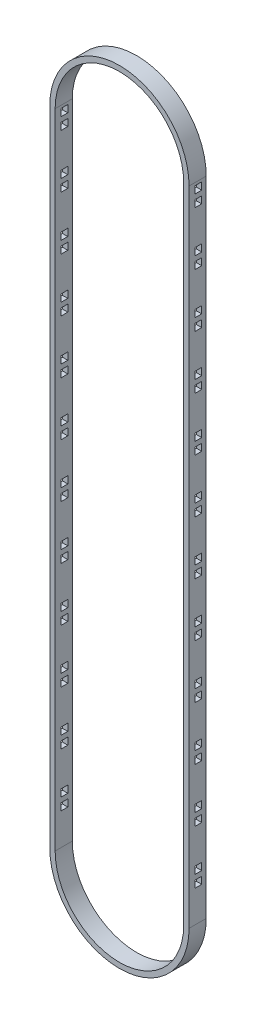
from build123d import *

# Parameters (mm, degrees)
EXTRUSION1_DEPTH        = 16
ESQUISSE2_W             = 6.322731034
ESQUISSE2_H             = 6.717901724
ESQUISSE2_H_2           = 6.553539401
ENL_V_MAT_EXTRU_1_DEPTH = 188


with BuildPart() as part:
    # Esquisse1 → Extrusion1 (new body)
    with BuildSketch(Plane.XY):
        with BuildLine():
            Line((65, 0), (65, -600))
            ThreePointArc((65, -600), (0, -665), (-65, -600))
            Line((-65, -600), (-65, 0))
            ThreePointArc((-65, 0), (0, 65), (65, 0))
        make_face()
        with BuildLine():
            Line((60, 0), (60, -600))
            ThreePointArc((60, -600), (0, -660), (-60, -600))
            Line((-60, -600), (-60, 0))
            ThreePointArc((-60, 0), (0, 60), (60, 0))
        make_face(mode=Mode.SUBTRACT)
    extrude(amount=EXTRUSION1_DEPTH)

    # Esquisse2 → Enl_v. mat.-Extru.1 (cut)
    with BuildSketch(Plane(origin=(65, 0, 0), x_dir=(0, 0, -1), z_dir=(1, 0, 0))):
        with Locations((-7.35609323, -55.880928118)):
            Rectangle(ESQUISSE2_W, ESQUISSE2_H)
        with Locations((-7.35609323, -5.880928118)):
            Rectangle(ESQUISSE2_W, ESQUISSE2_H)
        with Locations((-7.35609323, -105.880928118)):
            Rectangle(ESQUISSE2_W, ESQUISSE2_H)
        with Locations((-7.35609323, -155.880928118)):
            Rectangle(ESQUISSE2_W, ESQUISSE2_H)
        with Locations((-7.35609323, -205.880928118)):
            Rectangle(ESQUISSE2_W, ESQUISSE2_H)
        with Locations((-7.35609323, -255.880928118)):
            Rectangle(ESQUISSE2_W, ESQUISSE2_H)
        with Locations((-7.35609323, -305.880928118)):
            Rectangle(ESQUISSE2_W, ESQUISSE2_H)
        with Locations((-7.35609323, -355.880928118)):
            Rectangle(ESQUISSE2_W, ESQUISSE2_H)
        with Locations((-7.35609323, -405.880928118)):
            Rectangle(ESQUISSE2_W, ESQUISSE2_H)
        with Locations((-7.35609323, -455.880928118)):
            Rectangle(ESQUISSE2_W, ESQUISSE2_H)
        with Locations((-7.35609323, -505.880928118)):
            Rectangle(ESQUISSE2_W, ESQUISSE2_H)
        with Locations((-7.35609323, -555.880928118)):
            Rectangle(ESQUISSE2_W, ESQUISSE2_H)
        with Locations((-7.35609323, -67.077939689)):
            Rectangle(ESQUISSE2_W, ESQUISSE2_H_2)
        with Locations((-7.35609323, -17.077939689)):
            Rectangle(ESQUISSE2_W, ESQUISSE2_H_2)
        with Locations((-7.35609323, -117.077939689)):
            Rectangle(ESQUISSE2_W, ESQUISSE2_H_2)
        with Locations((-7.35609323, -167.077939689)):
            Rectangle(ESQUISSE2_W, ESQUISSE2_H_2)
        with Locations((-7.35609323, -217.077939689)):
            Rectangle(ESQUISSE2_W, ESQUISSE2_H_2)
        with Locations((-7.35609323, -267.077939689)):
            Rectangle(ESQUISSE2_W, ESQUISSE2_H_2)
        with Locations((-7.35609323, -317.077939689)):
            Rectangle(ESQUISSE2_W, ESQUISSE2_H_2)
        with Locations((-7.35609323, -367.077939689)):
            Rectangle(ESQUISSE2_W, ESQUISSE2_H_2)
        with Locations((-7.35609323, -417.077939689)):
            Rectangle(ESQUISSE2_W, ESQUISSE2_H_2)
        with Locations((-7.35609323, -467.077939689)):
            Rectangle(ESQUISSE2_W, ESQUISSE2_H_2)
        with Locations((-7.35609323, -517.077939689)):
            Rectangle(ESQUISSE2_W, ESQUISSE2_H_2)
        with Locations((-7.35609323, -567.077939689)):
            Rectangle(ESQUISSE2_W, ESQUISSE2_H_2)
    extrude(amount=-ENL_V_MAT_EXTRU_1_DEPTH, mode=Mode.SUBTRACT)


solid = part.part
